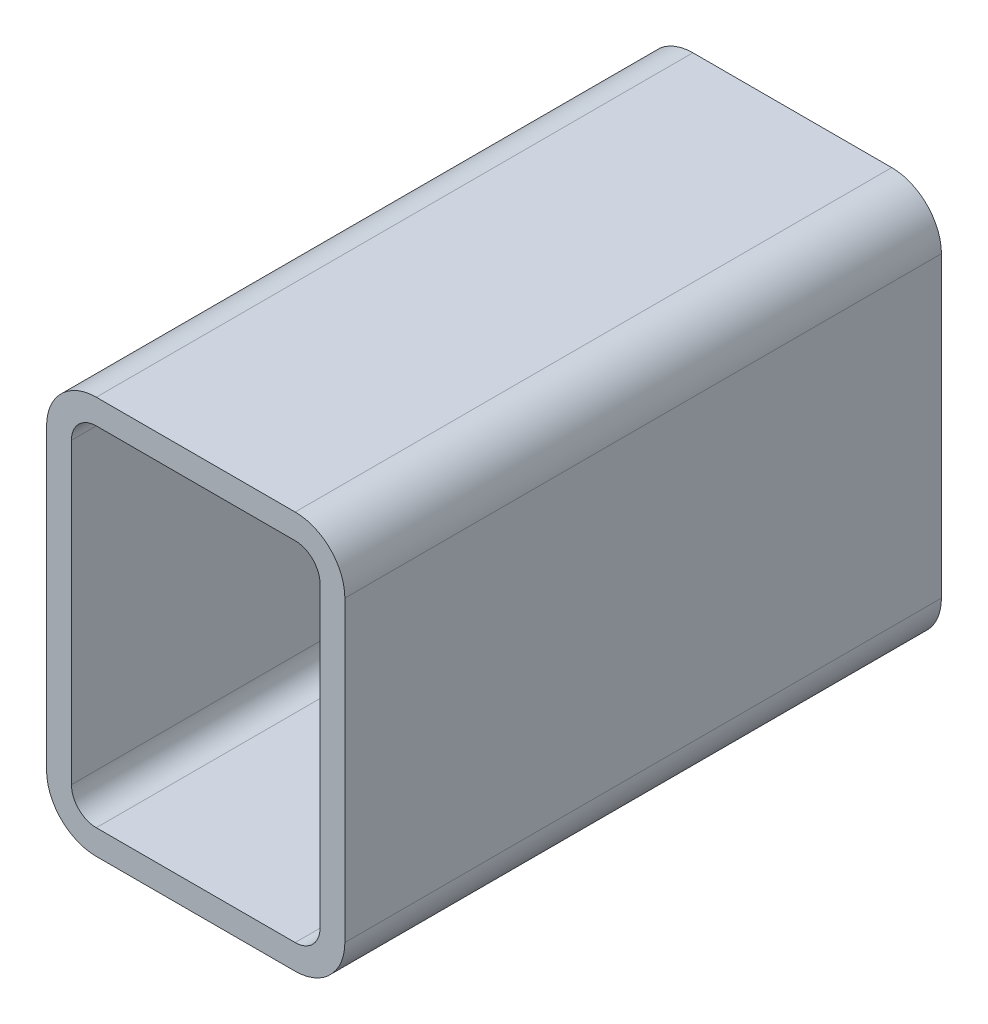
ISO-10303-21;
HEADER;
FILE_DESCRIPTION(('STEP AP214'),'2;1');
FILE_NAME('part.step','',(''),(''),'','','');
FILE_SCHEMA(('AUTOMOTIVE_DESIGN { 1 0 10303 214 1 1 1 1 }'));
ENDSEC;
DATA;
#1=APPLICATION_CONTEXT('core data for automotive mechanical design processes');
#2=APPLICATION_PROTOCOL_DEFINITION('international standard','automotive_design',2000,#1);
#3=PRODUCT_CONTEXT('',#1,'mechanical');
#4=PRODUCT('Part','Part','',(#3));
#5=PRODUCT_RELATED_PRODUCT_CATEGORY('part','',(#4));
#6=PRODUCT_DEFINITION_FORMATION('','',#4);
#7=PRODUCT_DEFINITION_CONTEXT('part definition',#1,'design');
#8=PRODUCT_DEFINITION('design','',#6,#7);
#9=PRODUCT_DEFINITION_SHAPE('','',#8);
#10=(LENGTH_UNIT() NAMED_UNIT(*) SI_UNIT(.MILLI.,.METRE.));
#11=(NAMED_UNIT(*) PLANE_ANGLE_UNIT() SI_UNIT($,.RADIAN.));
#12=(NAMED_UNIT(*) SI_UNIT($,.STERADIAN.) SOLID_ANGLE_UNIT());
#13=UNCERTAINTY_MEASURE_WITH_UNIT(LENGTH_MEASURE(1.E-05),#10,'distance_accuracy_value','');
#14=(GEOMETRIC_REPRESENTATION_CONTEXT(3) GLOBAL_UNCERTAINTY_ASSIGNED_CONTEXT((#13)) GLOBAL_UNIT_ASSIGNED_CONTEXT((#10,
#11,#12)) REPRESENTATION_CONTEXT('',''));
#15=CARTESIAN_POINT('',(0.,0.,0.));
#16=DIRECTION('',(0.,0.,1.));
#17=DIRECTION('',(1.,0.,0.));
#18=AXIS2_PLACEMENT_3D('',#15,#16,#17);
#19=CARTESIAN_POINT('',(25.4473013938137,179.766130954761,304.8));
#20=DIRECTION('',(0.,0.,1.));
#21=DIRECTION('',(1.,0.,0.));
#22=AXIS2_PLACEMENT_3D('',#19,#20,#21);
#23=PLANE('',#22);
#24=CARTESIAN_POINT('',(25.4473013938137,179.766130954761,304.8));
#25=DIRECTION('',(0.,0.,1.));
#26=DIRECTION('',(1.,0.,0.));
#27=AXIS2_PLACEMENT_3D('',#24,#25,#26);
#28=CIRCLE('',#27,25.4);
#29=CARTESIAN_POINT('',(25.4473013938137,205.166130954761,304.8));
#30=VERTEX_POINT('',#29);
#31=CARTESIAN_POINT('',(0.0473013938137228,179.766130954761,304.8));
#32=VERTEX_POINT('',#31);
#33=EDGE_CURVE('E211',#30,#32,#28,.T.);
#34=ORIENTED_EDGE('',*,*,#33,.T.);
#35=DIRECTION('',(0.,-1.,0.));
#36=VECTOR('',#35,1.);
#37=CARTESIAN_POINT('',(0.0473013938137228,27.3661309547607,304.8));
#38=LINE('',#37,#36);
#39=CARTESIAN_POINT('',(0.0473013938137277,27.3661309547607,304.8));
#40=VERTEX_POINT('',#39);
#41=EDGE_CURVE('E214',#32,#40,#38,.T.);
#42=ORIENTED_EDGE('',*,*,#41,.T.);
#43=CARTESIAN_POINT('',(25.4473013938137,27.3661309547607,304.8));
#44=DIRECTION('',(0.,0.,1.));
#45=DIRECTION('',(1.,0.,0.));
#46=AXIS2_PLACEMENT_3D('',#43,#44,#45);
#47=CIRCLE('',#46,25.4);
#48=CARTESIAN_POINT('',(25.4473013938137,1.96613095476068,304.8));
#49=VERTEX_POINT('',#48);
#50=EDGE_CURVE('E217',#40,#49,#47,.T.);
#51=ORIENTED_EDGE('',*,*,#50,.T.);
#52=DIRECTION('',(1.,0.,0.));
#53=VECTOR('',#52,1.);
#54=CARTESIAN_POINT('',(127.047301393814,1.96613095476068,304.8));
#55=LINE('',#54,#53);
#56=CARTESIAN_POINT('',(127.047301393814,1.96613095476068,304.8));
#57=VERTEX_POINT('',#56);
#58=EDGE_CURVE('E219',#49,#57,#55,.T.);
#59=ORIENTED_EDGE('',*,*,#58,.T.);
#60=CARTESIAN_POINT('',(127.047301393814,27.3661309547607,304.8));
#61=DIRECTION('',(0.,0.,1.));
#62=DIRECTION('',(1.,0.,0.));
#63=AXIS2_PLACEMENT_3D('',#60,#61,#62);
#64=CIRCLE('',#63,25.4);
#65=CARTESIAN_POINT('',(152.447301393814,27.3661309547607,304.8));
#66=VERTEX_POINT('',#65);
#67=EDGE_CURVE('E221',#57,#66,#64,.T.);
#68=ORIENTED_EDGE('',*,*,#67,.T.);
#69=DIRECTION('',(0.,1.,0.));
#70=VECTOR('',#69,1.);
#71=CARTESIAN_POINT('',(152.447301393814,179.766130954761,304.8));
#72=LINE('',#71,#70);
#73=CARTESIAN_POINT('',(152.447301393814,179.766130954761,304.8));
#74=VERTEX_POINT('',#73);
#75=EDGE_CURVE('E223',#66,#74,#72,.T.);
#76=ORIENTED_EDGE('',*,*,#75,.T.);
#77=CARTESIAN_POINT('',(127.047301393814,179.766130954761,304.8));
#78=DIRECTION('',(0.,0.,1.));
#79=DIRECTION('',(1.,0.,0.));
#80=AXIS2_PLACEMENT_3D('',#77,#78,#79);
#81=CIRCLE('',#80,25.4);
#82=CARTESIAN_POINT('',(127.047301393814,205.166130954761,304.8));
#83=VERTEX_POINT('',#82);
#84=EDGE_CURVE('E225',#74,#83,#81,.T.);
#85=ORIENTED_EDGE('',*,*,#84,.T.);
#86=DIRECTION('',(-1.,0.,0.));
#87=VECTOR('',#86,1.);
#88=CARTESIAN_POINT('',(25.4473013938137,205.166130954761,304.8));
#89=LINE('',#88,#87);
#90=EDGE_CURVE('E227',#83,#30,#89,.T.);
#91=ORIENTED_EDGE('',*,*,#90,.T.);
#92=EDGE_LOOP('',(#34,#42,#51,#59,#68,#76,#85,#91));
#93=FACE_BOUND('',#92,.T.);
#94=DIRECTION('',(0.,-1.,0.));
#95=VECTOR('',#94,1.);
#96=CARTESIAN_POINT('',(12.7473013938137,27.3661309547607,304.8));
#97=LINE('',#96,#95);
#98=CARTESIAN_POINT('',(12.7473013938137,179.766130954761,304.8));
#99=VERTEX_POINT('',#98);
#100=CARTESIAN_POINT('',(12.7473013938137,27.3661309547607,304.8));
#101=VERTEX_POINT('',#100);
#102=EDGE_CURVE('E154',#99,#101,#97,.T.);
#103=ORIENTED_EDGE('',*,*,#102,.F.);
#104=CARTESIAN_POINT('',(25.4473013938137,179.766130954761,304.8));
#105=DIRECTION('',(0.,0.,1.));
#106=DIRECTION('',(1.,0.,0.));
#107=AXIS2_PLACEMENT_3D('',#104,#105,#106);
#108=CIRCLE('',#107,12.7);
#109=CARTESIAN_POINT('',(25.4473013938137,192.466130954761,304.8));
#110=VERTEX_POINT('',#109);
#111=EDGE_CURVE('E146',#110,#99,#108,.T.);
#112=ORIENTED_EDGE('',*,*,#111,.F.);
#113=DIRECTION('',(-1.,0.,0.));
#114=VECTOR('',#113,1.);
#115=CARTESIAN_POINT('',(25.4473013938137,192.466130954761,304.8));
#116=LINE('',#115,#114);
#117=CARTESIAN_POINT('',(127.047301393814,192.466130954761,304.8));
#118=VERTEX_POINT('',#117);
#119=EDGE_CURVE('E179',#118,#110,#116,.T.);
#120=ORIENTED_EDGE('',*,*,#119,.F.);
#121=CARTESIAN_POINT('',(127.047301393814,179.766130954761,304.8));
#122=DIRECTION('',(0.,0.,1.));
#123=DIRECTION('',(1.,0.,0.));
#124=AXIS2_PLACEMENT_3D('',#121,#122,#123);
#125=CIRCLE('',#124,12.7);
#126=CARTESIAN_POINT('',(139.747301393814,179.766130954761,304.8));
#127=VERTEX_POINT('',#126);
#128=EDGE_CURVE('E177',#127,#118,#125,.T.);
#129=ORIENTED_EDGE('',*,*,#128,.F.);
#130=DIRECTION('',(0.,1.,0.));
#131=VECTOR('',#130,1.);
#132=CARTESIAN_POINT('',(139.747301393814,179.766130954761,304.8));
#133=LINE('',#132,#131);
#134=CARTESIAN_POINT('',(139.747301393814,27.3661309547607,304.8));
#135=VERTEX_POINT('',#134);
#136=EDGE_CURVE('E175',#135,#127,#133,.T.);
#137=ORIENTED_EDGE('',*,*,#136,.F.);
#138=CARTESIAN_POINT('',(127.047301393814,27.3661309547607,304.8));
#139=DIRECTION('',(0.,0.,1.));
#140=DIRECTION('',(1.,0.,0.));
#141=AXIS2_PLACEMENT_3D('',#138,#139,#140);
#142=CIRCLE('',#141,12.7);
#143=CARTESIAN_POINT('',(127.047301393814,14.6661309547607,304.8));
#144=VERTEX_POINT('',#143);
#145=EDGE_CURVE('E173',#144,#135,#142,.T.);
#146=ORIENTED_EDGE('',*,*,#145,.F.);
#147=DIRECTION('',(1.,0.,0.));
#148=VECTOR('',#147,1.);
#149=CARTESIAN_POINT('',(127.047301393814,14.6661309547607,304.8));
#150=LINE('',#149,#148);
#151=CARTESIAN_POINT('',(25.4473013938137,14.6661309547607,304.8));
#152=VERTEX_POINT('',#151);
#153=EDGE_CURVE('E169',#152,#144,#150,.T.);
#154=ORIENTED_EDGE('',*,*,#153,.F.);
#155=CARTESIAN_POINT('',(25.4473013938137,27.3661309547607,304.8));
#156=DIRECTION('',(0.,0.,1.));
#157=DIRECTION('',(1.,0.,0.));
#158=AXIS2_PLACEMENT_3D('',#155,#156,#157);
#159=CIRCLE('',#158,12.7);
#160=EDGE_CURVE('E167',#101,#152,#159,.T.);
#161=ORIENTED_EDGE('',*,*,#160,.F.);
#162=EDGE_LOOP('',(#103,#112,#120,#129,#137,#146,#154,#161));
#163=FACE_BOUND('',#162,.T.);
#164=ADVANCED_FACE('F33',(#93,#163),#23,.T.);
#165=CARTESIAN_POINT('',(25.4473013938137,179.766130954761,0.));
#166=DIRECTION('',(0.,0.,1.));
#167=DIRECTION('',(1.,0.,0.));
#168=AXIS2_PLACEMENT_3D('',#165,#166,#167);
#169=PLANE('',#168);
#170=CARTESIAN_POINT('',(25.4473013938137,179.766130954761,0.));
#171=DIRECTION('',(0.,0.,1.));
#172=DIRECTION('',(1.,0.,0.));
#173=AXIS2_PLACEMENT_3D('',#170,#171,#172);
#174=CIRCLE('',#173,25.4);
#175=CARTESIAN_POINT('',(25.4473013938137,205.166130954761,0.));
#176=VERTEX_POINT('',#175);
#177=CARTESIAN_POINT('',(0.0473013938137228,179.766130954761,0.));
#178=VERTEX_POINT('',#177);
#179=EDGE_CURVE('E162',#176,#178,#174,.T.);
#180=ORIENTED_EDGE('',*,*,#179,.F.);
#181=DIRECTION('',(-1.,0.,0.));
#182=VECTOR('',#181,1.);
#183=CARTESIAN_POINT('',(25.4473013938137,205.166130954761,0.));
#184=LINE('',#183,#182);
#185=CARTESIAN_POINT('',(127.047301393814,205.166130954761,0.));
#186=VERTEX_POINT('',#185);
#187=EDGE_CURVE('E215',#186,#176,#184,.T.);
#188=ORIENTED_EDGE('',*,*,#187,.F.);
#189=CARTESIAN_POINT('',(127.047301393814,179.766130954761,0.));
#190=DIRECTION('',(0.,0.,1.));
#191=DIRECTION('',(1.,0.,0.));
#192=AXIS2_PLACEMENT_3D('',#189,#190,#191);
#193=CIRCLE('',#192,25.4);
#194=CARTESIAN_POINT('',(152.447301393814,179.766130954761,0.));
#195=VERTEX_POINT('',#194);
#196=EDGE_CURVE('E242',#195,#186,#193,.T.);
#197=ORIENTED_EDGE('',*,*,#196,.F.);
#198=DIRECTION('',(0.,1.,0.));
#199=VECTOR('',#198,1.);
#200=CARTESIAN_POINT('',(152.447301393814,179.766130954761,0.));
#201=LINE('',#200,#199);
#202=CARTESIAN_POINT('',(152.447301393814,27.3661309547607,0.));
#203=VERTEX_POINT('',#202);
#204=EDGE_CURVE('E240',#203,#195,#201,.T.);
#205=ORIENTED_EDGE('',*,*,#204,.F.);
#206=CARTESIAN_POINT('',(127.047301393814,27.3661309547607,0.));
#207=DIRECTION('',(0.,0.,1.));
#208=DIRECTION('',(1.,0.,0.));
#209=AXIS2_PLACEMENT_3D('',#206,#207,#208);
#210=CIRCLE('',#209,25.4);
#211=CARTESIAN_POINT('',(127.047301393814,1.96613095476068,0.));
#212=VERTEX_POINT('',#211);
#213=EDGE_CURVE('E238',#212,#203,#210,.T.);
#214=ORIENTED_EDGE('',*,*,#213,.F.);
#215=DIRECTION('',(1.,0.,0.));
#216=VECTOR('',#215,1.);
#217=CARTESIAN_POINT('',(127.047301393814,1.96613095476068,0.));
#218=LINE('',#217,#216);
#219=CARTESIAN_POINT('',(25.4473013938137,1.96613095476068,0.));
#220=VERTEX_POINT('',#219);
#221=EDGE_CURVE('E236',#220,#212,#218,.T.);
#222=ORIENTED_EDGE('',*,*,#221,.F.);
#223=CARTESIAN_POINT('',(25.4473013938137,27.3661309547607,0.));
#224=DIRECTION('',(0.,0.,1.));
#225=DIRECTION('',(1.,0.,0.));
#226=AXIS2_PLACEMENT_3D('',#223,#224,#225);
#227=CIRCLE('',#226,25.4);
#228=CARTESIAN_POINT('',(0.0473013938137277,27.3661309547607,0.));
#229=VERTEX_POINT('',#228);
#230=EDGE_CURVE('E234',#229,#220,#227,.T.);
#231=ORIENTED_EDGE('',*,*,#230,.F.);
#232=DIRECTION('',(0.,-1.,0.));
#233=VECTOR('',#232,1.);
#234=CARTESIAN_POINT('',(0.0473013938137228,27.3661309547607,0.));
#235=LINE('',#234,#233);
#236=EDGE_CURVE('E232',#178,#229,#235,.T.);
#237=ORIENTED_EDGE('',*,*,#236,.F.);
#238=EDGE_LOOP('',(#180,#188,#197,#205,#214,#222,#231,#237));
#239=FACE_BOUND('',#238,.T.);
#240=CARTESIAN_POINT('',(25.4473013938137,179.766130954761,0.));
#241=DIRECTION('',(0.,0.,1.));
#242=DIRECTION('',(1.,0.,0.));
#243=AXIS2_PLACEMENT_3D('',#240,#241,#242);
#244=CIRCLE('',#243,12.7);
#245=CARTESIAN_POINT('',(25.4473013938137,192.466130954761,0.));
#246=VERTEX_POINT('',#245);
#247=CARTESIAN_POINT('',(12.7473013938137,179.766130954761,0.));
#248=VERTEX_POINT('',#247);
#249=EDGE_CURVE('E56',#246,#248,#244,.T.);
#250=ORIENTED_EDGE('',*,*,#249,.T.);
#251=DIRECTION('',(0.,-1.,0.));
#252=VECTOR('',#251,1.);
#253=CARTESIAN_POINT('',(12.7473013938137,27.3661309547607,0.));
#254=LINE('',#253,#252);
#255=CARTESIAN_POINT('',(12.7473013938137,27.3661309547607,0.));
#256=VERTEX_POINT('',#255);
#257=EDGE_CURVE('E161',#248,#256,#254,.T.);
#258=ORIENTED_EDGE('',*,*,#257,.T.);
#259=CARTESIAN_POINT('',(25.4473013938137,27.3661309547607,0.));
#260=DIRECTION('',(0.,0.,1.));
#261=DIRECTION('',(1.,0.,0.));
#262=AXIS2_PLACEMENT_3D('',#259,#260,#261);
#263=CIRCLE('',#262,12.7);
#264=CARTESIAN_POINT('',(25.4473013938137,14.6661309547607,0.));
#265=VERTEX_POINT('',#264);
#266=EDGE_CURVE('E183',#256,#265,#263,.T.);
#267=ORIENTED_EDGE('',*,*,#266,.T.);
#268=DIRECTION('',(1.,0.,0.));
#269=VECTOR('',#268,1.);
#270=CARTESIAN_POINT('',(127.047301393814,14.6661309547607,0.));
#271=LINE('',#270,#269);
#272=CARTESIAN_POINT('',(127.047301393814,14.6661309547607,0.));
#273=VERTEX_POINT('',#272);
#274=EDGE_CURVE('E186',#265,#273,#271,.T.);
#275=ORIENTED_EDGE('',*,*,#274,.T.);
#276=CARTESIAN_POINT('',(127.047301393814,27.3661309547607,0.));
#277=DIRECTION('',(0.,0.,1.));
#278=DIRECTION('',(1.,0.,0.));
#279=AXIS2_PLACEMENT_3D('',#276,#277,#278);
#280=CIRCLE('',#279,12.7);
#281=CARTESIAN_POINT('',(139.747301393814,27.3661309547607,0.));
#282=VERTEX_POINT('',#281);
#283=EDGE_CURVE('E189',#273,#282,#280,.T.);
#284=ORIENTED_EDGE('',*,*,#283,.T.);
#285=DIRECTION('',(0.,1.,0.));
#286=VECTOR('',#285,1.);
#287=CARTESIAN_POINT('',(139.747301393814,179.766130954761,0.));
#288=LINE('',#287,#286);
#289=CARTESIAN_POINT('',(139.747301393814,179.766130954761,0.));
#290=VERTEX_POINT('',#289);
#291=EDGE_CURVE('E192',#282,#290,#288,.T.);
#292=ORIENTED_EDGE('',*,*,#291,.T.);
#293=CARTESIAN_POINT('',(127.047301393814,179.766130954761,0.));
#294=DIRECTION('',(0.,0.,1.));
#295=DIRECTION('',(1.,0.,0.));
#296=AXIS2_PLACEMENT_3D('',#293,#294,#295);
#297=CIRCLE('',#296,12.7);
#298=CARTESIAN_POINT('',(127.047301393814,192.466130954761,0.));
#299=VERTEX_POINT('',#298);
#300=EDGE_CURVE('E195',#290,#299,#297,.T.);
#301=ORIENTED_EDGE('',*,*,#300,.T.);
#302=DIRECTION('',(-1.,0.,0.));
#303=VECTOR('',#302,1.);
#304=CARTESIAN_POINT('',(25.4473013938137,192.466130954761,0.));
#305=LINE('',#304,#303);
#306=EDGE_CURVE('E155',#299,#246,#305,.T.);
#307=ORIENTED_EDGE('',*,*,#306,.T.);
#308=EDGE_LOOP('',(#250,#258,#267,#275,#284,#292,#301,#307));
#309=FACE_BOUND('',#308,.T.);
#310=ADVANCED_FACE('F272',(#239,#309),#169,.F.);
#311=CARTESIAN_POINT('',(25.4473013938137,179.766130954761,304.8));
#312=DIRECTION('',(0.,0.,-1.));
#313=DIRECTION('',(-1.,0.,0.));
#314=AXIS2_PLACEMENT_3D('',#311,#312,#313);
#315=CYLINDRICAL_SURFACE('',#314,25.4);
#316=ORIENTED_EDGE('',*,*,#179,.T.);
#317=DIRECTION('',(0.,0.,-1.));
#318=VECTOR('',#317,1.);
#319=CARTESIAN_POINT('',(0.0473013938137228,179.766130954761,304.8));
#320=LINE('',#319,#318);
#321=EDGE_CURVE('E11',#32,#178,#320,.T.);
#322=ORIENTED_EDGE('',*,*,#321,.F.);
#323=ORIENTED_EDGE('',*,*,#33,.F.);
#324=DIRECTION('',(0.,0.,-1.));
#325=VECTOR('',#324,1.);
#326=CARTESIAN_POINT('',(25.4473013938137,205.166130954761,304.8));
#327=LINE('',#326,#325);
#328=EDGE_CURVE('E229',#30,#176,#327,.T.);
#329=ORIENTED_EDGE('',*,*,#328,.T.);
#330=EDGE_LOOP('',(#316,#322,#323,#329));
#331=FACE_BOUND('',#330,.T.);
#332=ADVANCED_FACE('F35',(#331),#315,.T.);
#333=CARTESIAN_POINT('',(0.0473013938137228,27.3661309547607,304.8));
#334=DIRECTION('',(1.,0.,0.));
#335=DIRECTION('',(0.,0.,-1.));
#336=AXIS2_PLACEMENT_3D('',#333,#334,#335);
#337=PLANE('',#336);
#338=ORIENTED_EDGE('',*,*,#236,.T.);
#339=DIRECTION('',(0.,0.,-1.));
#340=VECTOR('',#339,1.);
#341=CARTESIAN_POINT('',(0.0473013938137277,27.3661309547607,304.8));
#342=LINE('',#341,#340);
#343=EDGE_CURVE('E41',#40,#229,#342,.T.);
#344=ORIENTED_EDGE('',*,*,#343,.F.);
#345=ORIENTED_EDGE('',*,*,#41,.F.);
#346=ORIENTED_EDGE('',*,*,#321,.T.);
#347=EDGE_LOOP('',(#338,#344,#345,#346));
#348=FACE_BOUND('',#347,.T.);
#349=ADVANCED_FACE('F289',(#348),#337,.F.);
#350=CARTESIAN_POINT('',(25.4473013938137,27.3661309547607,304.8));
#351=DIRECTION('',(0.,0.,-1.));
#352=DIRECTION('',(-1.,0.,0.));
#353=AXIS2_PLACEMENT_3D('',#350,#351,#352);
#354=CYLINDRICAL_SURFACE('',#353,25.4);
#355=ORIENTED_EDGE('',*,*,#230,.T.);
#356=DIRECTION('',(0.,0.,-1.));
#357=VECTOR('',#356,1.);
#358=CARTESIAN_POINT('',(25.4473013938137,1.96613095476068,304.8));
#359=LINE('',#358,#357);
#360=EDGE_CURVE('E259',#49,#220,#359,.T.);
#361=ORIENTED_EDGE('',*,*,#360,.F.);
#362=ORIENTED_EDGE('',*,*,#50,.F.);
#363=ORIENTED_EDGE('',*,*,#343,.T.);
#364=EDGE_LOOP('',(#355,#361,#362,#363));
#365=FACE_BOUND('',#364,.T.);
#366=ADVANCED_FACE('F266',(#365),#354,.T.);
#367=CARTESIAN_POINT('',(127.047301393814,1.96613095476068,304.8));
#368=DIRECTION('',(0.,1.,0.));
#369=DIRECTION('',(0.,0.,1.));
#370=AXIS2_PLACEMENT_3D('',#367,#368,#369);
#371=PLANE('',#370);
#372=ORIENTED_EDGE('',*,*,#221,.T.);
#373=DIRECTION('',(0.,0.,-1.));
#374=VECTOR('',#373,1.);
#375=CARTESIAN_POINT('',(127.047301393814,1.96613095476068,304.8));
#376=LINE('',#375,#374);
#377=EDGE_CURVE('E256',#57,#212,#376,.T.);
#378=ORIENTED_EDGE('',*,*,#377,.F.);
#379=ORIENTED_EDGE('',*,*,#58,.F.);
#380=ORIENTED_EDGE('',*,*,#360,.T.);
#381=EDGE_LOOP('',(#372,#378,#379,#380));
#382=FACE_BOUND('',#381,.T.);
#383=ADVANCED_FACE('F278',(#382),#371,.F.);
#384=CARTESIAN_POINT('',(127.047301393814,27.3661309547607,304.8));
#385=DIRECTION('',(0.,0.,-1.));
#386=DIRECTION('',(-1.,0.,0.));
#387=AXIS2_PLACEMENT_3D('',#384,#385,#386);
#388=CYLINDRICAL_SURFACE('',#387,25.4);
#389=ORIENTED_EDGE('',*,*,#213,.T.);
#390=DIRECTION('',(0.,0.,-1.));
#391=VECTOR('',#390,1.);
#392=CARTESIAN_POINT('',(152.447301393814,27.3661309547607,304.8));
#393=LINE('',#392,#391);
#394=EDGE_CURVE('E253',#66,#203,#393,.T.);
#395=ORIENTED_EDGE('',*,*,#394,.F.);
#396=ORIENTED_EDGE('',*,*,#67,.F.);
#397=ORIENTED_EDGE('',*,*,#377,.T.);
#398=EDGE_LOOP('',(#389,#395,#396,#397));
#399=FACE_BOUND('',#398,.T.);
#400=ADVANCED_FACE('F282',(#399),#388,.T.);
#401=CARTESIAN_POINT('',(152.447301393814,179.766130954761,304.8));
#402=DIRECTION('',(-1.,0.,0.));
#403=DIRECTION('',(0.,0.,1.));
#404=AXIS2_PLACEMENT_3D('',#401,#402,#403);
#405=PLANE('',#404);
#406=ORIENTED_EDGE('',*,*,#204,.T.);
#407=DIRECTION('',(0.,0.,-1.));
#408=VECTOR('',#407,1.);
#409=CARTESIAN_POINT('',(152.447301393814,179.766130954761,304.8));
#410=LINE('',#409,#408);
#411=EDGE_CURVE('E250',#74,#195,#410,.T.);
#412=ORIENTED_EDGE('',*,*,#411,.F.);
#413=ORIENTED_EDGE('',*,*,#75,.F.);
#414=ORIENTED_EDGE('',*,*,#394,.T.);
#415=EDGE_LOOP('',(#406,#412,#413,#414));
#416=FACE_BOUND('',#415,.T.);
#417=ADVANCED_FACE('F302',(#416),#405,.F.);
#418=CARTESIAN_POINT('',(127.047301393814,179.766130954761,304.8));
#419=DIRECTION('',(0.,0.,-1.));
#420=DIRECTION('',(-1.,0.,0.));
#421=AXIS2_PLACEMENT_3D('',#418,#419,#420);
#422=CYLINDRICAL_SURFACE('',#421,25.4);
#423=ORIENTED_EDGE('',*,*,#196,.T.);
#424=DIRECTION('',(0.,0.,-1.));
#425=VECTOR('',#424,1.);
#426=CARTESIAN_POINT('',(127.047301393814,205.166130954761,304.8));
#427=LINE('',#426,#425);
#428=EDGE_CURVE('E247',#83,#186,#427,.T.);
#429=ORIENTED_EDGE('',*,*,#428,.F.);
#430=ORIENTED_EDGE('',*,*,#84,.F.);
#431=ORIENTED_EDGE('',*,*,#411,.T.);
#432=EDGE_LOOP('',(#423,#429,#430,#431));
#433=FACE_BOUND('',#432,.T.);
#434=ADVANCED_FACE('F300',(#433),#422,.T.);
#435=CARTESIAN_POINT('',(25.4473013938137,205.166130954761,304.8));
#436=DIRECTION('',(0.,-1.,0.));
#437=DIRECTION('',(0.,0.,-1.));
#438=AXIS2_PLACEMENT_3D('',#435,#436,#437);
#439=PLANE('',#438);
#440=ORIENTED_EDGE('',*,*,#187,.T.);
#441=ORIENTED_EDGE('',*,*,#328,.F.);
#442=ORIENTED_EDGE('',*,*,#90,.F.);
#443=ORIENTED_EDGE('',*,*,#428,.T.);
#444=EDGE_LOOP('',(#440,#441,#442,#443));
#445=FACE_BOUND('',#444,.T.);
#446=ADVANCED_FACE('F295',(#445),#439,.F.);
#447=CARTESIAN_POINT('',(25.4473013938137,179.766130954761,304.8));
#448=DIRECTION('',(0.,0.,-1.));
#449=DIRECTION('',(-1.,0.,0.));
#450=AXIS2_PLACEMENT_3D('',#447,#448,#449);
#451=CYLINDRICAL_SURFACE('',#450,12.7);
#452=ORIENTED_EDGE('',*,*,#249,.F.);
#453=DIRECTION('',(0.,0.,-1.));
#454=VECTOR('',#453,1.);
#455=CARTESIAN_POINT('',(25.4473013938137,192.466130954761,304.8));
#456=LINE('',#455,#454);
#457=EDGE_CURVE('E150',#110,#246,#456,.T.);
#458=ORIENTED_EDGE('',*,*,#457,.F.);
#459=ORIENTED_EDGE('',*,*,#111,.T.);
#460=DIRECTION('',(0.,0.,-1.));
#461=VECTOR('',#460,1.);
#462=CARTESIAN_POINT('',(12.7473013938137,179.766130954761,304.8));
#463=LINE('',#462,#461);
#464=EDGE_CURVE('E149',#99,#248,#463,.T.);
#465=ORIENTED_EDGE('',*,*,#464,.T.);
#466=EDGE_LOOP('',(#452,#458,#459,#465));
#467=FACE_BOUND('',#466,.T.);
#468=ADVANCED_FACE('F148',(#467),#451,.F.);
#469=CARTESIAN_POINT('',(12.7473013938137,27.3661309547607,304.8));
#470=DIRECTION('',(1.,0.,0.));
#471=DIRECTION('',(0.,0.,-1.));
#472=AXIS2_PLACEMENT_3D('',#469,#470,#471);
#473=PLANE('',#472);
#474=ORIENTED_EDGE('',*,*,#257,.F.);
#475=ORIENTED_EDGE('',*,*,#464,.F.);
#476=ORIENTED_EDGE('',*,*,#102,.T.);
#477=DIRECTION('',(0.,0.,-1.));
#478=VECTOR('',#477,1.);
#479=CARTESIAN_POINT('',(12.7473013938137,27.3661309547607,304.8));
#480=LINE('',#479,#478);
#481=EDGE_CURVE('E163',#101,#256,#480,.T.);
#482=ORIENTED_EDGE('',*,*,#481,.T.);
#483=EDGE_LOOP('',(#474,#475,#476,#482));
#484=FACE_BOUND('',#483,.T.);
#485=ADVANCED_FACE('F158',(#484),#473,.T.);
#486=CARTESIAN_POINT('',(25.4473013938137,27.3661309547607,304.8));
#487=DIRECTION('',(0.,0.,-1.));
#488=DIRECTION('',(-1.,0.,0.));
#489=AXIS2_PLACEMENT_3D('',#486,#487,#488);
#490=CYLINDRICAL_SURFACE('',#489,12.7);
#491=ORIENTED_EDGE('',*,*,#266,.F.);
#492=ORIENTED_EDGE('',*,*,#481,.F.);
#493=ORIENTED_EDGE('',*,*,#160,.T.);
#494=DIRECTION('',(0.,0.,-1.));
#495=VECTOR('',#494,1.);
#496=CARTESIAN_POINT('',(25.4473013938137,14.6661309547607,304.8));
#497=LINE('',#496,#495);
#498=EDGE_CURVE('E208',#152,#265,#497,.T.);
#499=ORIENTED_EDGE('',*,*,#498,.T.);
#500=EDGE_LOOP('',(#491,#492,#493,#499));
#501=FACE_BOUND('',#500,.T.);
#502=ADVANCED_FACE('F327',(#501),#490,.F.);
#503=CARTESIAN_POINT('',(127.047301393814,14.6661309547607,304.8));
#504=DIRECTION('',(0.,1.,0.));
#505=DIRECTION('',(0.,0.,1.));
#506=AXIS2_PLACEMENT_3D('',#503,#504,#505);
#507=PLANE('',#506);
#508=ORIENTED_EDGE('',*,*,#274,.F.);
#509=ORIENTED_EDGE('',*,*,#498,.F.);
#510=ORIENTED_EDGE('',*,*,#153,.T.);
#511=DIRECTION('',(0.,0.,-1.));
#512=VECTOR('',#511,1.);
#513=CARTESIAN_POINT('',(127.047301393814,14.6661309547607,304.8));
#514=LINE('',#513,#512);
#515=EDGE_CURVE('E206',#144,#273,#514,.T.);
#516=ORIENTED_EDGE('',*,*,#515,.T.);
#517=EDGE_LOOP('',(#508,#509,#510,#516));
#518=FACE_BOUND('',#517,.T.);
#519=ADVANCED_FACE('F331',(#518),#507,.T.);
#520=CARTESIAN_POINT('',(127.047301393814,27.3661309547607,304.8));
#521=DIRECTION('',(0.,0.,-1.));
#522=DIRECTION('',(-1.,0.,0.));
#523=AXIS2_PLACEMENT_3D('',#520,#521,#522);
#524=CYLINDRICAL_SURFACE('',#523,12.7);
#525=ORIENTED_EDGE('',*,*,#283,.F.);
#526=ORIENTED_EDGE('',*,*,#515,.F.);
#527=ORIENTED_EDGE('',*,*,#145,.T.);
#528=DIRECTION('',(0.,0.,-1.));
#529=VECTOR('',#528,1.);
#530=CARTESIAN_POINT('',(139.747301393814,27.3661309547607,304.8));
#531=LINE('',#530,#529);
#532=EDGE_CURVE('E204',#135,#282,#531,.T.);
#533=ORIENTED_EDGE('',*,*,#532,.T.);
#534=EDGE_LOOP('',(#525,#526,#527,#533));
#535=FACE_BOUND('',#534,.T.);
#536=ADVANCED_FACE('F337',(#535),#524,.F.);
#537=CARTESIAN_POINT('',(139.747301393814,179.766130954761,304.8));
#538=DIRECTION('',(-1.,0.,0.));
#539=DIRECTION('',(0.,0.,1.));
#540=AXIS2_PLACEMENT_3D('',#537,#538,#539);
#541=PLANE('',#540);
#542=ORIENTED_EDGE('',*,*,#291,.F.);
#543=ORIENTED_EDGE('',*,*,#532,.F.);
#544=ORIENTED_EDGE('',*,*,#136,.T.);
#545=DIRECTION('',(0.,0.,-1.));
#546=VECTOR('',#545,1.);
#547=CARTESIAN_POINT('',(139.747301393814,179.766130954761,304.8));
#548=LINE('',#547,#546);
#549=EDGE_CURVE('E202',#127,#290,#548,.T.);
#550=ORIENTED_EDGE('',*,*,#549,.T.);
#551=EDGE_LOOP('',(#542,#543,#544,#550));
#552=FACE_BOUND('',#551,.T.);
#553=ADVANCED_FACE('F341',(#552),#541,.T.);
#554=CARTESIAN_POINT('',(127.047301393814,179.766130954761,304.8));
#555=DIRECTION('',(0.,0.,-1.));
#556=DIRECTION('',(-1.,0.,0.));
#557=AXIS2_PLACEMENT_3D('',#554,#555,#556);
#558=CYLINDRICAL_SURFACE('',#557,12.7);
#559=ORIENTED_EDGE('',*,*,#300,.F.);
#560=ORIENTED_EDGE('',*,*,#549,.F.);
#561=ORIENTED_EDGE('',*,*,#128,.T.);
#562=DIRECTION('',(0.,0.,-1.));
#563=VECTOR('',#562,1.);
#564=CARTESIAN_POINT('',(127.047301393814,192.466130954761,304.8));
#565=LINE('',#564,#563);
#566=EDGE_CURVE('E48',#118,#299,#565,.T.);
#567=ORIENTED_EDGE('',*,*,#566,.T.);
#568=EDGE_LOOP('',(#559,#560,#561,#567));
#569=FACE_BOUND('',#568,.T.);
#570=ADVANCED_FACE('F345',(#569),#558,.F.);
#571=CARTESIAN_POINT('',(25.4473013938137,192.466130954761,304.8));
#572=DIRECTION('',(0.,-1.,0.));
#573=DIRECTION('',(0.,0.,-1.));
#574=AXIS2_PLACEMENT_3D('',#571,#572,#573);
#575=PLANE('',#574);
#576=ORIENTED_EDGE('',*,*,#306,.F.);
#577=ORIENTED_EDGE('',*,*,#566,.F.);
#578=ORIENTED_EDGE('',*,*,#119,.T.);
#579=ORIENTED_EDGE('',*,*,#457,.T.);
#580=EDGE_LOOP('',(#576,#577,#578,#579));
#581=FACE_BOUND('',#580,.T.);
#582=ADVANCED_FACE('F349',(#581),#575,.T.);
#583=CLOSED_SHELL('',(#164,#310,#332,#349,#366,#383,#400,#417,#434,#446,#468,#485,#502,#519,
#536,#553,#570,#582));
#584=MANIFOLD_SOLID_BREP('B2',#583);
#585=ADVANCED_BREP_SHAPE_REPRESENTATION('',(#18,#584),#14);
#586=SHAPE_DEFINITION_REPRESENTATION(#9,#585);
ENDSEC;
END-ISO-10303-21;
